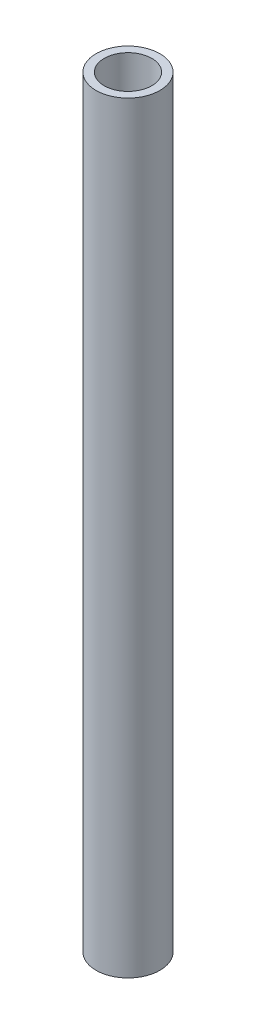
ISO-10303-21;
HEADER;
FILE_DESCRIPTION(('STEP AP214'),'2;1');
FILE_NAME('part.step','',(''),(''),'','','');
FILE_SCHEMA(('AUTOMOTIVE_DESIGN { 1 0 10303 214 1 1 1 1 }'));
ENDSEC;
DATA;
#1=APPLICATION_CONTEXT('core data for automotive mechanical design processes');
#2=APPLICATION_PROTOCOL_DEFINITION('international standard','automotive_design',2000,#1);
#3=PRODUCT_CONTEXT('',#1,'mechanical');
#4=PRODUCT('Part','Part','',(#3));
#5=PRODUCT_RELATED_PRODUCT_CATEGORY('part','',(#4));
#6=PRODUCT_DEFINITION_FORMATION('','',#4);
#7=PRODUCT_DEFINITION_CONTEXT('part definition',#1,'design');
#8=PRODUCT_DEFINITION('design','',#6,#7);
#9=PRODUCT_DEFINITION_SHAPE('','',#8);
#10=(LENGTH_UNIT() NAMED_UNIT(*) SI_UNIT(.MILLI.,.METRE.));
#11=(NAMED_UNIT(*) PLANE_ANGLE_UNIT() SI_UNIT($,.RADIAN.));
#12=(NAMED_UNIT(*) SI_UNIT($,.STERADIAN.) SOLID_ANGLE_UNIT());
#13=UNCERTAINTY_MEASURE_WITH_UNIT(LENGTH_MEASURE(1.E-05),#10,'distance_accuracy_value','');
#14=(GEOMETRIC_REPRESENTATION_CONTEXT(3) GLOBAL_UNCERTAINTY_ASSIGNED_CONTEXT((#13)) GLOBAL_UNIT_ASSIGNED_CONTEXT((#10,
#11,#12)) REPRESENTATION_CONTEXT('',''));
#15=CARTESIAN_POINT('',(0.,0.,0.));
#16=DIRECTION('',(0.,0.,1.));
#17=DIRECTION('',(1.,0.,0.));
#18=AXIS2_PLACEMENT_3D('',#15,#16,#17);
#19=CARTESIAN_POINT('',(0.,95.25,0.));
#20=DIRECTION('',(0.,1.,0.));
#21=DIRECTION('',(0.,0.,1.));
#22=AXIS2_PLACEMENT_3D('',#19,#20,#21);
#23=PLANE('',#22);
#24=CARTESIAN_POINT('',(0.,95.25,0.));
#25=DIRECTION('',(0.,1.,0.));
#26=DIRECTION('',(0.,0.,1.));
#27=AXIS2_PLACEMENT_3D('',#24,#25,#26);
#28=CIRCLE('',#27,3.9878);
#29=CARTESIAN_POINT('',(0.,95.25,3.9878));
#30=VERTEX_POINT('',#29);
#31=EDGE_CURVE('E10',#30,#30,#28,.T.);
#32=ORIENTED_EDGE('',*,*,#31,.T.);
#33=EDGE_LOOP('',(#32));
#34=FACE_BOUND('',#33,.T.);
#35=CARTESIAN_POINT('',(0.,95.25,0.));
#36=DIRECTION('',(0.,1.,0.));
#37=DIRECTION('',(0.,0.,1.));
#38=AXIS2_PLACEMENT_3D('',#35,#36,#37);
#39=CIRCLE('',#38,2.9718);
#40=CARTESIAN_POINT('',(0.,95.25,2.9718));
#41=VERTEX_POINT('',#40);
#42=EDGE_CURVE('E52',#41,#41,#39,.T.);
#43=ORIENTED_EDGE('',*,*,#42,.F.);
#44=EDGE_LOOP('',(#43));
#45=FACE_BOUND('',#44,.T.);
#46=ADVANCED_FACE('F39',(#34,#45),#23,.T.);
#47=CARTESIAN_POINT('',(0.,0.,0.));
#48=DIRECTION('',(0.,1.,0.));
#49=DIRECTION('',(0.,0.,1.));
#50=AXIS2_PLACEMENT_3D('',#47,#48,#49);
#51=PLANE('',#50);
#52=CARTESIAN_POINT('',(0.,0.,0.));
#53=DIRECTION('',(0.,1.,0.));
#54=DIRECTION('',(0.,0.,1.));
#55=AXIS2_PLACEMENT_3D('',#52,#53,#54);
#56=CIRCLE('',#55,3.9878);
#57=CARTESIAN_POINT('',(0.,0.,3.9878));
#58=VERTEX_POINT('',#57);
#59=EDGE_CURVE('E43',#58,#58,#56,.T.);
#60=ORIENTED_EDGE('',*,*,#59,.F.);
#61=EDGE_LOOP('',(#60));
#62=FACE_BOUND('',#61,.T.);
#63=CARTESIAN_POINT('',(0.,0.,0.));
#64=DIRECTION('',(0.,1.,0.));
#65=DIRECTION('',(0.,0.,1.));
#66=AXIS2_PLACEMENT_3D('',#63,#64,#65);
#67=CIRCLE('',#66,2.9718);
#68=CARTESIAN_POINT('',(0.,0.,2.9718));
#69=VERTEX_POINT('',#68);
#70=EDGE_CURVE('E54',#69,#69,#67,.T.);
#71=ORIENTED_EDGE('',*,*,#70,.T.);
#72=EDGE_LOOP('',(#71));
#73=FACE_BOUND('',#72,.T.);
#74=ADVANCED_FACE('F66',(#62,#73),#51,.F.);
#75=CARTESIAN_POINT('',(0.,95.25,0.));
#76=DIRECTION('',(0.,-1.,0.));
#77=DIRECTION('',(0.,0.,-1.));
#78=AXIS2_PLACEMENT_3D('',#75,#76,#77);
#79=CYLINDRICAL_SURFACE('',#78,3.9878);
#80=ORIENTED_EDGE('',*,*,#31,.F.);
#81=EDGE_LOOP('',(#80));
#82=FACE_BOUND('',#81,.T.);
#83=ORIENTED_EDGE('',*,*,#59,.T.);
#84=EDGE_LOOP('',(#83));
#85=FACE_BOUND('',#84,.T.);
#86=ADVANCED_FACE('F41',(#82,#85),#79,.T.);
#87=CARTESIAN_POINT('',(0.,95.25,0.));
#88=DIRECTION('',(0.,-1.,0.));
#89=DIRECTION('',(0.,0.,-1.));
#90=AXIS2_PLACEMENT_3D('',#87,#88,#89);
#91=CYLINDRICAL_SURFACE('',#90,2.9718);
#92=ORIENTED_EDGE('',*,*,#42,.T.);
#93=EDGE_LOOP('',(#92));
#94=FACE_BOUND('',#93,.T.);
#95=ORIENTED_EDGE('',*,*,#70,.F.);
#96=EDGE_LOOP('',(#95));
#97=FACE_BOUND('',#96,.T.);
#98=ADVANCED_FACE('F62',(#94,#97),#91,.F.);
#99=CLOSED_SHELL('',(#46,#74,#86,#98));
#100=MANIFOLD_SOLID_BREP('B2',#99);
#101=ADVANCED_BREP_SHAPE_REPRESENTATION('',(#18,#100),#14);
#102=SHAPE_DEFINITION_REPRESENTATION(#9,#101);
ENDSEC;
END-ISO-10303-21;
